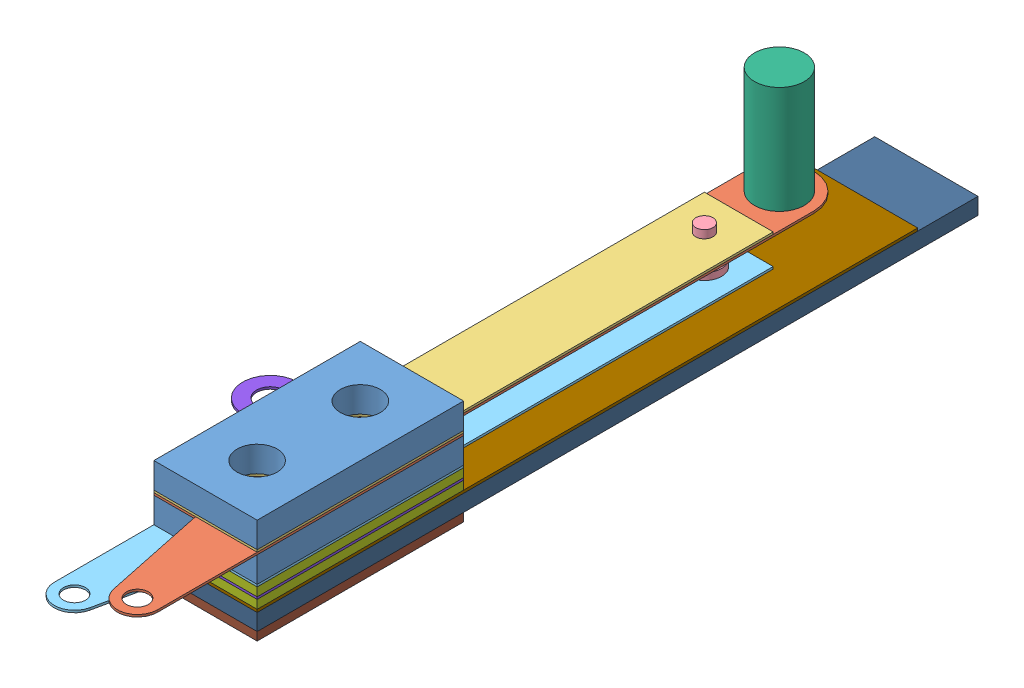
SolidWorks assembly Switch Stack SW-1A-141.SLDASM, configuration Default (file format 6000). Lengths in mm.
Overall size (17.84 17.01 77.57).
14 component instances, 11 part files, 36 mates.
Components (placement in the parent):
- Switch Stack Spacer.093-1: Switch Stack Spacer.093.SLDPRT [Default] at origin size (9.53 2.36 19.05)
- Switch Stack Leaf 2-1: Switch Stack Leaf 2.SLDPRT [Default] at (0 -0.4064 0) x (-1 0 0) z (0 0 1) size (9.53 0.2 67.18)
- Switch Stack Fish Paper A-1: Switch Stack Fish Paper A.SLDPRT [Default] at origin size (9.53 0.2 49.21)
- Contact-1: Contact.SLDPRT [Default] at (0 -0.4064 -36.5125) size (3.17 2.16 3.17)
- Switch Stack Spacer.093-2: Switch Stack Spacer.093.SLDPRT [Default] at (0 -2.7686 0) size (9.53 2.36 19.05)
- Switch Stack Leaf 1-1: Switch Stack Leaf 1.SLDPRT [Default] at (0 -2.7686 0) size (9.53 0.2 60.26)
- Contact-4: Contact.SLDPRT [Default] at (0 -2.7686 -36.5125) x (-0.837169 0 -0.546944) z (-0.546944 0 0.837169) size (3.17 2.16 3.17)
- Switch Stack Pin-1: Switch Stack Pin.SLDPRT [Default] at (0 -1.4732 -43.434) x (0.04475 0 -0.998998) z (0.998998 0 0.04475) size (4.6 11.18 4.6)
- Switch Stack Spacer.031-1: Switch Stack Spacer.031.SLDPRT [Default] at (0 -3.7655 0) size (9.53 0.79 19.05)
- Switch Stack Leaf 3-1: Switch Stack Leaf 3.SLDPRT [Default] at (0 -3.9688 0) x (-1 0 0) z (0 0 1) size (17.84 0.2 19.05)
- Switch Stack Spacer.031-2: Switch Stack Spacer.031.SLDPRT [Default] at (0 -4.7625 0) size (9.53 0.79 19.05)
- Switch Stack Fish Paper-1: Switch Stack Fish Paper.SLDPRT [Default] at (0 -4.7625 0) size (9.53 0.25 60.96)
- Switch Stack Backing plate-1: Switch Stack Backing plate.SLDPRT [Default] at (0 -6.5405 0) x (-1 0 0) z (0 0 1) size (9.53 1.52 66.52)
- Switch Stack Spring plate-1: Switch Stack Spring plate.SLDPRT [Default] at (0 -6.5405 0) size (9.53 0.76 19.05)
Mates (geometry in assembly coordinates):
- Coincident1: coincident anti-aligned: plane of Switch Stack Spacer.093-1 through (0 0 0) normal (0 -1 0); plane of Switch Stack Fish Paper A-1 through (0 0 0) normal (0 1 0)
- Concentric1: concentric aligned: cylinder of Switch Stack Spacer.093-1 through (0 0 4.7625) axis (0 1 0) radius 1.8542; cylinder of Switch Stack Fish Paper A-1 through (0 -0.2032 4.7625) axis (0 1 0) radius 1.8542
- Parallel1: parallel: plane of Switch Stack Spacer.093-1 through (4.7663 2.3622 9.525) normal (1 0 0); line of Switch Stack Fish Paper A-1 through (4.7663 -0.2032 9.525) axis (0 0 -1)
- Coincident4: coincident anti-aligned: plane of Switch Stack Leaf 2-1 through (0 -0.2032 0) normal (0 1 0); plane of Switch Stack Fish Paper A-1 through (0 -0.2032 0) normal (0 -1 0)
- Coincident5: coincident anti-aligned: cylinder of Switch Stack Spacer.093-1 through (0 0 4.7625) axis (0 1 0) radius 1.8542; circle of Switch Stack Leaf 2-1
- Parallel2: parallel: plane of Switch Stack Spacer.093-1 through (4.7663 2.3622 9.525) normal (1 0 0); line of Switch Stack Leaf 2-1 through (4.7663 -0.4064 -9.525) axis (0 0 1)
- Concentric2: concentric aligned: cylinder of Switch Stack Leaf 2-1 through (0 -0.2032 -36.5125) axis (0 -1 0) radius 0.7937; cylinder of Contact-1 through (0 0.7366 -36.5125) axis (0 -1 0) radius 0.7937
- Coincident7: coincident anti-aligned: plane of Switch Stack Leaf 2-1 through (0 -0.4064 0) normal (0 -1 0); plane of Contact-1 through (0 -0.4064 -36.5125) normal (0 1 0)
- Coincident8: coincident anti-aligned: plane of Switch Stack Leaf 2-1 through (0 -0.4064 0) normal (0 -1 0); plane of Switch Stack Spacer.093-2 through (0 -0.4064 0) normal (0 1 0)
- Concentric3: concentric aligned: cylinder of Switch Stack Spacer.093-1 through (0 0 4.7625) axis (0 1 0) radius 1.8542; cylinder of Switch Stack Spacer.093-2 through (0 -2.7686 4.7625) axis (0 1 0) radius 1.8542
- Concentric4: concentric aligned: cylinder of Switch Stack Spacer.093-1 through (0 0 -4.7625) axis (0 1 0) radius 1.8542; cylinder of Switch Stack Spacer.093-2 through (0 -2.7686 -4.7625) axis (0 1 0) radius 1.8542
- Coincident9: coincident anti-aligned: plane of Switch Stack Spacer.093-2 through (0 -2.7686 0) normal (0 -1 0); plane of Switch Stack Leaf 1-1 through (0 -2.7686 0) normal (0 1 0)
- Coincident10: coincident aligned: cylinder of Switch Stack Spacer.093-1 through (0 0 4.7625) axis (0 1 0) radius 1.8542; circle of Switch Stack Leaf 1-1
- Parallel3: parallel: plane of Switch Stack Spacer.093-1 through (4.7663 2.3622 9.525) normal (1 0 0); line of Switch Stack Leaf 1-1 through (4.7663 -2.9718 9.525) axis (0 0 -1)
- Coincident12: coincident aligned: circle of Switch Stack Leaf 1-1; cylinder of Contact-4 through (0 -3.9116 -36.5125) axis (0 1 0) radius 0.7937
- Coincident13: coincident anti-aligned: plane of Switch Stack Leaf 1-1 through (0 -2.7686 0) normal (0 1 0); plane of Contact-4 through (0 -2.7686 -36.5125) normal (0 -1 0)
- Concentric5: concentric anti-aligned: circle of Switch Stack Leaf 2-1; cylinder of Switch Stack Pin-1 through (0 -1.4732 -43.434) axis (0 -1 0) radius 2.2987
- Coincident14: coincident anti-aligned: plane of Switch Stack Leaf 2-1 through (0 -0.2032 0) normal (0 1 0); plane of Switch Stack Pin-1 through (-2.2964 -0.2032 -43.5369) normal (0 -1 0)
- Coincident15: coincident anti-aligned: plane of Switch Stack Leaf 1-1 through (0 -2.9718 0) normal (0 -1 0); plane of Switch Stack Spacer.031-1 through (0 -2.9718 0) normal (0 1 0)
- Coincident16: coincident aligned: cylinder of Switch Stack Spacer.093-1 through (0 0 4.7625) axis (0 1 0) radius 1.8542; circle of Switch Stack Spacer.031-1
- Parallel4: parallel: plane of Switch Stack Spacer.093-1 through (4.7663 2.3622 9.525) normal (1 0 0); line of Switch Stack Spacer.031-1 through (4.7663 -3.7655 9.525) axis (0 0 -1)
- Coincident18: coincident anti-aligned: plane of Switch Stack Spacer.031-1 through (0 -3.7655 0) normal (0 -1 0); plane of Switch Stack Leaf 3-1 through (0 -3.7655 0) normal (0 1 0)
- Coincident19: coincident anti-aligned: cylinder of Switch Stack Spacer.093-1 through (0 0 4.7625) axis (0 1 0) radius 1.8542; circle of Switch Stack Leaf 3-1
- Parallel5: parallel: plane of Switch Stack Spacer.093-1 through (4.7663 2.3622 9.525) normal (1 0 0); line of Switch Stack Leaf 3-1 through (4.7663 -3.7655 -9.525) axis (0 0 1)
- Coincident21: coincident anti-aligned: plane of Switch Stack Leaf 3-1 through (0 -3.9688 0) normal (0 -1 0); plane of Switch Stack Spacer.031-2 through (0 -3.9688 0) normal (0 1 0)
- Concentric6: concentric aligned: cylinder of Switch Stack Spacer.093-1 through (0 0 4.7625) axis (0 1 0) radius 1.8542; cylinder of Switch Stack Spacer.031-2 through (0 -4.7625 4.7625) axis (0 1 0) radius 1.8542
- Parallel6: parallel: plane of Switch Stack Spacer.093-1 through (4.7663 2.3622 9.525) normal (1 0 0); line of Switch Stack Spacer.031-2 through (4.7663 -4.7625 9.525) axis (0 0 -1)
- Coincident23: coincident anti-aligned: plane of Switch Stack Spacer.031-2 through (0 -4.7625 0) normal (0 -1 0); plane of Switch Stack Fish Paper-1 through (0 -4.7625 0) normal (0 1 0)
- Coincident24: coincident anti-aligned: cylinder of Switch Stack Spacer.093-1 through (0 0 4.7625) axis (0 1 0) radius 1.8542; circle of Switch Stack Fish Paper-1
- Parallel7: parallel: plane of Switch Stack Spacer.093-1 through (4.7663 2.3622 9.525) normal (1 0 0); line of Switch Stack Fish Paper-1 through (4.7663 -5.0165 9.525) axis (0 0 -1)
- Coincident26: coincident anti-aligned: plane of Switch Stack Fish Paper-1 through (0 -5.0165 0) normal (0 -1 0); plane of Switch Stack Backing plate-1 through (0 -5.0165 0) normal (0 1 0)
- Concentric7: concentric anti-aligned: cylinder of Switch Stack Spacer.093-1 through (0 0 4.7625) axis (0 1 0) radius 1.8542; cylinder of Switch Stack Backing plate-1 through (0 -5.0165 4.7625) axis (0 -1 0) radius 1.8542
- Coincident27: coincident: plane of Switch Stack Spacer.093-1 through (4.7663 2.3622 9.525) normal (1 0 0); line of Switch Stack Backing plate-1 through (4.7663 -6.5405 -56.9976) axis (0 0 1)
- Coincident28: coincident anti-aligned: plane of Switch Stack Backing plate-1 through (0 -6.5405 0) normal (0 -1 0); plane of Switch Stack Spring plate-1 through (0 -6.5405 0) normal (0 1 0)
- Concentric8: concentric aligned: cylinder of Switch Stack Spacer.093-1 through (0 0 4.7625) axis (0 1 0) radius 1.8542; circle of Switch Stack Spring plate-1
- Parallel8: parallel: plane of Switch Stack Spacer.093-1 through (4.7663 2.3622 9.525) normal (1 0 0); line of Switch Stack Spring plate-1 through (4.7663 -7.3025 9.525) axis (0 0 -1)
